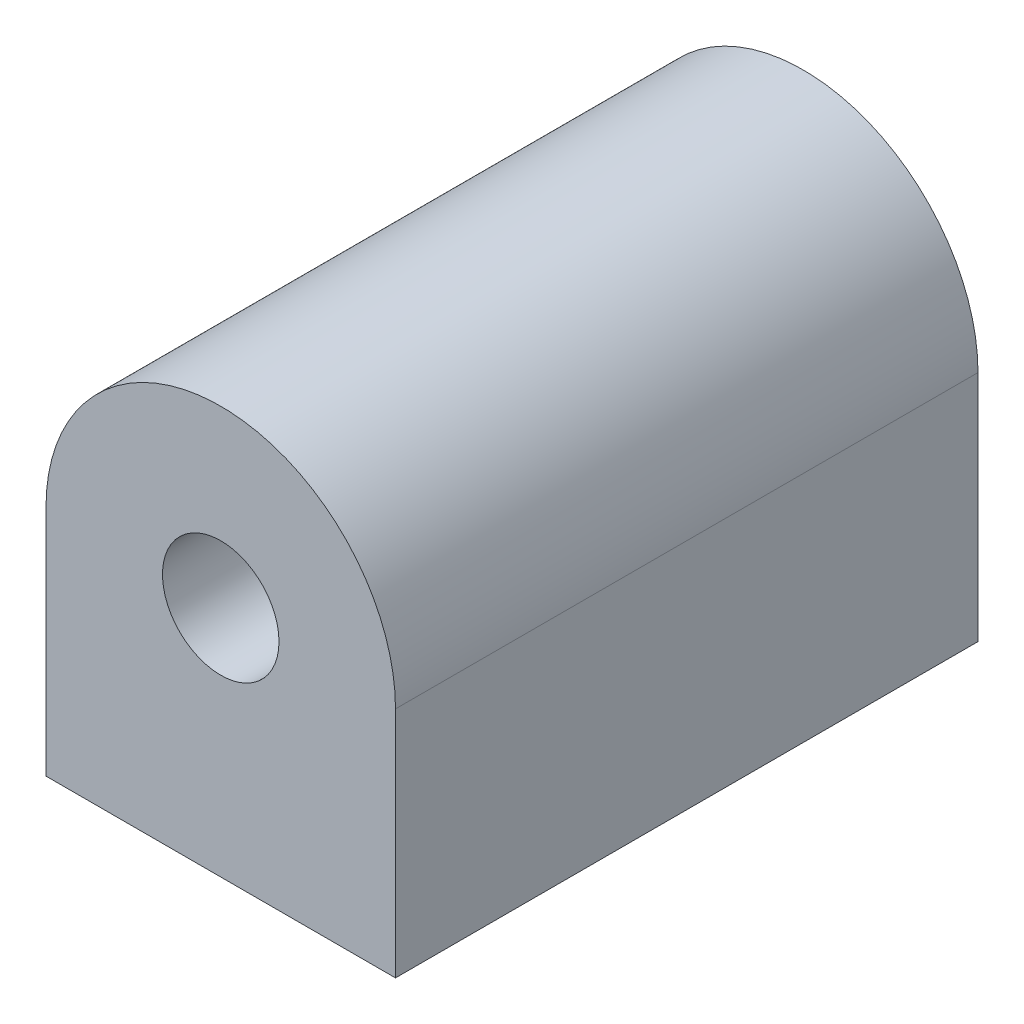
ISO-10303-21;
HEADER;
FILE_DESCRIPTION(('STEP AP214'),'2;1');
FILE_NAME('part.step','',(''),(''),'','','');
FILE_SCHEMA(('AUTOMOTIVE_DESIGN { 1 0 10303 214 1 1 1 1 }'));
ENDSEC;
DATA;
#1=APPLICATION_CONTEXT('core data for automotive mechanical design processes');
#2=APPLICATION_PROTOCOL_DEFINITION('international standard','automotive_design',2000,#1);
#3=PRODUCT_CONTEXT('',#1,'mechanical');
#4=PRODUCT('Part','Part','',(#3));
#5=PRODUCT_RELATED_PRODUCT_CATEGORY('part','',(#4));
#6=PRODUCT_DEFINITION_FORMATION('','',#4);
#7=PRODUCT_DEFINITION_CONTEXT('part definition',#1,'design');
#8=PRODUCT_DEFINITION('design','',#6,#7);
#9=PRODUCT_DEFINITION_SHAPE('','',#8);
#10=(LENGTH_UNIT() NAMED_UNIT(*) SI_UNIT(.MILLI.,.METRE.));
#11=(NAMED_UNIT(*) PLANE_ANGLE_UNIT() SI_UNIT($,.RADIAN.));
#12=(NAMED_UNIT(*) SI_UNIT($,.STERADIAN.) SOLID_ANGLE_UNIT());
#13=UNCERTAINTY_MEASURE_WITH_UNIT(LENGTH_MEASURE(1.E-05),#10,'distance_accuracy_value','');
#14=(GEOMETRIC_REPRESENTATION_CONTEXT(3) GLOBAL_UNCERTAINTY_ASSIGNED_CONTEXT((#13)) GLOBAL_UNIT_ASSIGNED_CONTEXT((#10,
#11,#12)) REPRESENTATION_CONTEXT('',''));
#15=CARTESIAN_POINT('',(0.,0.,0.));
#16=DIRECTION('',(0.,0.,1.));
#17=DIRECTION('',(1.,0.,0.));
#18=AXIS2_PLACEMENT_3D('',#15,#16,#17);
#19=CARTESIAN_POINT('',(0.,0.,25.));
#20=DIRECTION('',(0.,0.,-1.));
#21=DIRECTION('',(-1.,0.,0.));
#22=AXIS2_PLACEMENT_3D('',#19,#20,#21);
#23=CYLINDRICAL_SURFACE('',#22,15.);
#24=CARTESIAN_POINT('',(0.,0.,-25.));
#25=DIRECTION('',(0.,0.,1.));
#26=DIRECTION('',(1.,0.,0.));
#27=AXIS2_PLACEMENT_3D('',#24,#25,#26);
#28=CIRCLE('',#27,15.);
#29=CARTESIAN_POINT('',(15.,0.,-25.));
#30=VERTEX_POINT('',#29);
#31=CARTESIAN_POINT('',(-15.,0.,-25.));
#32=VERTEX_POINT('',#31);
#33=EDGE_CURVE('E95',#30,#32,#28,.T.);
#34=ORIENTED_EDGE('',*,*,#33,.T.);
#35=DIRECTION('',(0.,0.,-1.));
#36=VECTOR('',#35,1.);
#37=CARTESIAN_POINT('',(-15.,0.,25.));
#38=LINE('',#37,#36);
#39=CARTESIAN_POINT('',(-15.,0.,25.));
#40=VERTEX_POINT('',#39);
#41=EDGE_CURVE('E11',#40,#32,#38,.T.);
#42=ORIENTED_EDGE('',*,*,#41,.F.);
#43=CARTESIAN_POINT('',(0.,0.,25.));
#44=DIRECTION('',(0.,0.,1.));
#45=DIRECTION('',(1.,0.,0.));
#46=AXIS2_PLACEMENT_3D('',#43,#44,#45);
#47=CIRCLE('',#46,15.);
#48=CARTESIAN_POINT('',(15.,0.,25.));
#49=VERTEX_POINT('',#48);
#50=EDGE_CURVE('E83',#49,#40,#47,.T.);
#51=ORIENTED_EDGE('',*,*,#50,.F.);
#52=DIRECTION('',(0.,0.,-1.));
#53=VECTOR('',#52,1.);
#54=CARTESIAN_POINT('',(15.,0.,25.));
#55=LINE('',#54,#53);
#56=EDGE_CURVE('E91',#49,#30,#55,.T.);
#57=ORIENTED_EDGE('',*,*,#56,.T.);
#58=EDGE_LOOP('',(#34,#42,#51,#57));
#59=FACE_BOUND('',#58,.T.);
#60=ADVANCED_FACE('F32',(#59),#23,.T.);
#61=CARTESIAN_POINT('',(-15.,0.,25.));
#62=DIRECTION('',(1.,0.,0.));
#63=DIRECTION('',(0.,1.,0.));
#64=AXIS2_PLACEMENT_3D('',#61,#62,#63);
#65=PLANE('',#64);
#66=DIRECTION('',(0.,-1.,0.));
#67=VECTOR('',#66,1.);
#68=CARTESIAN_POINT('',(-15.,0.,-25.));
#69=LINE('',#68,#67);
#70=CARTESIAN_POINT('',(-15.,-20.,-25.));
#71=VERTEX_POINT('',#70);
#72=EDGE_CURVE('E87',#32,#71,#69,.T.);
#73=ORIENTED_EDGE('',*,*,#72,.T.);
#74=DIRECTION('',(0.,0.,-1.));
#75=VECTOR('',#74,1.);
#76=CARTESIAN_POINT('',(-15.,-20.,25.));
#77=LINE('',#76,#75);
#78=CARTESIAN_POINT('',(-15.,-20.,25.));
#79=VERTEX_POINT('',#78);
#80=EDGE_CURVE('E40',#79,#71,#77,.T.);
#81=ORIENTED_EDGE('',*,*,#80,.F.);
#82=DIRECTION('',(0.,-1.,0.));
#83=VECTOR('',#82,1.);
#84=CARTESIAN_POINT('',(-15.,0.,25.));
#85=LINE('',#84,#83);
#86=EDGE_CURVE('E78',#40,#79,#85,.T.);
#87=ORIENTED_EDGE('',*,*,#86,.F.);
#88=ORIENTED_EDGE('',*,*,#41,.T.);
#89=EDGE_LOOP('',(#73,#81,#87,#88));
#90=FACE_BOUND('',#89,.T.);
#91=ADVANCED_FACE('F86',(#90),#65,.F.);
#92=CARTESIAN_POINT('',(-15.,-20.,25.));
#93=DIRECTION('',(0.,1.,0.));
#94=DIRECTION('',(-1.,0.,0.));
#95=AXIS2_PLACEMENT_3D('',#92,#93,#94);
#96=PLANE('',#95);
#97=DIRECTION('',(1.,0.,0.));
#98=VECTOR('',#97,1.);
#99=CARTESIAN_POINT('',(-15.,-20.,-25.));
#100=LINE('',#99,#98);
#101=CARTESIAN_POINT('',(15.,-20.,-25.));
#102=VERTEX_POINT('',#101);
#103=EDGE_CURVE('E65',#71,#102,#100,.T.);
#104=ORIENTED_EDGE('',*,*,#103,.T.);
#105=DIRECTION('',(0.,0.,-1.));
#106=VECTOR('',#105,1.);
#107=CARTESIAN_POINT('',(15.,-20.,25.));
#108=LINE('',#107,#106);
#109=CARTESIAN_POINT('',(15.,-20.,25.));
#110=VERTEX_POINT('',#109);
#111=EDGE_CURVE('E88',#110,#102,#108,.T.);
#112=ORIENTED_EDGE('',*,*,#111,.F.);
#113=DIRECTION('',(1.,0.,0.));
#114=VECTOR('',#113,1.);
#115=CARTESIAN_POINT('',(-15.,-20.,25.));
#116=LINE('',#115,#114);
#117=EDGE_CURVE('E81',#79,#110,#116,.T.);
#118=ORIENTED_EDGE('',*,*,#117,.F.);
#119=ORIENTED_EDGE('',*,*,#80,.T.);
#120=EDGE_LOOP('',(#104,#112,#118,#119));
#121=FACE_BOUND('',#120,.T.);
#122=ADVANCED_FACE('F89',(#121),#96,.F.);
#123=CARTESIAN_POINT('',(15.,0.,25.));
#124=DIRECTION('',(-1.,0.,0.));
#125=DIRECTION('',(0.,-1.,0.));
#126=AXIS2_PLACEMENT_3D('',#123,#124,#125);
#127=PLANE('',#126);
#128=DIRECTION('',(0.,1.,0.));
#129=VECTOR('',#128,1.);
#130=CARTESIAN_POINT('',(15.,0.,-25.));
#131=LINE('',#130,#129);
#132=EDGE_CURVE('E71',#102,#30,#131,.T.);
#133=ORIENTED_EDGE('',*,*,#132,.T.);
#134=ORIENTED_EDGE('',*,*,#56,.F.);
#135=DIRECTION('',(0.,1.,0.));
#136=VECTOR('',#135,1.);
#137=CARTESIAN_POINT('',(15.,0.,25.));
#138=LINE('',#137,#136);
#139=EDGE_CURVE('E48',#110,#49,#138,.T.);
#140=ORIENTED_EDGE('',*,*,#139,.F.);
#141=ORIENTED_EDGE('',*,*,#111,.T.);
#142=EDGE_LOOP('',(#133,#134,#140,#141));
#143=FACE_BOUND('',#142,.T.);
#144=ADVANCED_FACE('F103',(#143),#127,.F.);
#145=CARTESIAN_POINT('',(0.,0.,25.));
#146=DIRECTION('',(0.,0.,1.));
#147=DIRECTION('',(1.,0.,0.));
#148=AXIS2_PLACEMENT_3D('',#145,#146,#147);
#149=PLANE('',#148);
#150=CARTESIAN_POINT('',(0.,0.,25.));
#151=DIRECTION('',(0.,0.,1.));
#152=DIRECTION('',(1.,0.,0.));
#153=AXIS2_PLACEMENT_3D('',#150,#151,#152);
#154=CIRCLE('',#153,5.);
#155=CARTESIAN_POINT('',(5.,0.,25.));
#156=VERTEX_POINT('',#155);
#157=EDGE_CURVE('E109',#156,#156,#154,.T.);
#158=ORIENTED_EDGE('',*,*,#157,.F.);
#159=EDGE_LOOP('',(#158));
#160=FACE_BOUND('',#159,.T.);
#161=ORIENTED_EDGE('',*,*,#50,.T.);
#162=ORIENTED_EDGE('',*,*,#86,.T.);
#163=ORIENTED_EDGE('',*,*,#117,.T.);
#164=ORIENTED_EDGE('',*,*,#139,.T.);
#165=EDGE_LOOP('',(#161,#162,#163,#164));
#166=FACE_BOUND('',#165,.T.);
#167=ADVANCED_FACE('F79',(#160,#166),#149,.T.);
#168=CARTESIAN_POINT('',(0.,0.,-25.));
#169=DIRECTION('',(0.,0.,1.));
#170=DIRECTION('',(1.,0.,0.));
#171=AXIS2_PLACEMENT_3D('',#168,#169,#170);
#172=PLANE('',#171);
#173=CARTESIAN_POINT('',(0.,0.,-25.));
#174=DIRECTION('',(0.,0.,1.));
#175=DIRECTION('',(1.,0.,0.));
#176=AXIS2_PLACEMENT_3D('',#173,#174,#175);
#177=CIRCLE('',#176,5.);
#178=CARTESIAN_POINT('',(5.,0.,-25.));
#179=VERTEX_POINT('',#178);
#180=EDGE_CURVE('E98',#179,#179,#177,.T.);
#181=ORIENTED_EDGE('',*,*,#180,.T.);
#182=EDGE_LOOP('',(#181));
#183=FACE_BOUND('',#182,.T.);
#184=ORIENTED_EDGE('',*,*,#33,.F.);
#185=ORIENTED_EDGE('',*,*,#132,.F.);
#186=ORIENTED_EDGE('',*,*,#103,.F.);
#187=ORIENTED_EDGE('',*,*,#72,.F.);
#188=EDGE_LOOP('',(#184,#185,#186,#187));
#189=FACE_BOUND('',#188,.T.);
#190=ADVANCED_FACE('F106',(#183,#189),#172,.F.);
#191=CARTESIAN_POINT('',(0.,0.,-25.));
#192=DIRECTION('',(0.,0.,1.));
#193=DIRECTION('',(1.,0.,0.));
#194=AXIS2_PLACEMENT_3D('',#191,#192,#193);
#195=CYLINDRICAL_SURFACE('',#194,5.);
#196=ORIENTED_EDGE('',*,*,#180,.F.);
#197=EDGE_LOOP('',(#196));
#198=FACE_BOUND('',#197,.T.);
#199=ORIENTED_EDGE('',*,*,#157,.T.);
#200=EDGE_LOOP('',(#199));
#201=FACE_BOUND('',#200,.T.);
#202=ADVANCED_FACE('F116',(#198,#201),#195,.F.);
#203=CLOSED_SHELL('',(#60,#91,#122,#144,#167,#190,#202));
#204=MANIFOLD_SOLID_BREP('B2',#203);
#205=ADVANCED_BREP_SHAPE_REPRESENTATION('',(#18,#204),#14);
#206=SHAPE_DEFINITION_REPRESENTATION(#9,#205);
ENDSEC;
END-ISO-10303-21;
